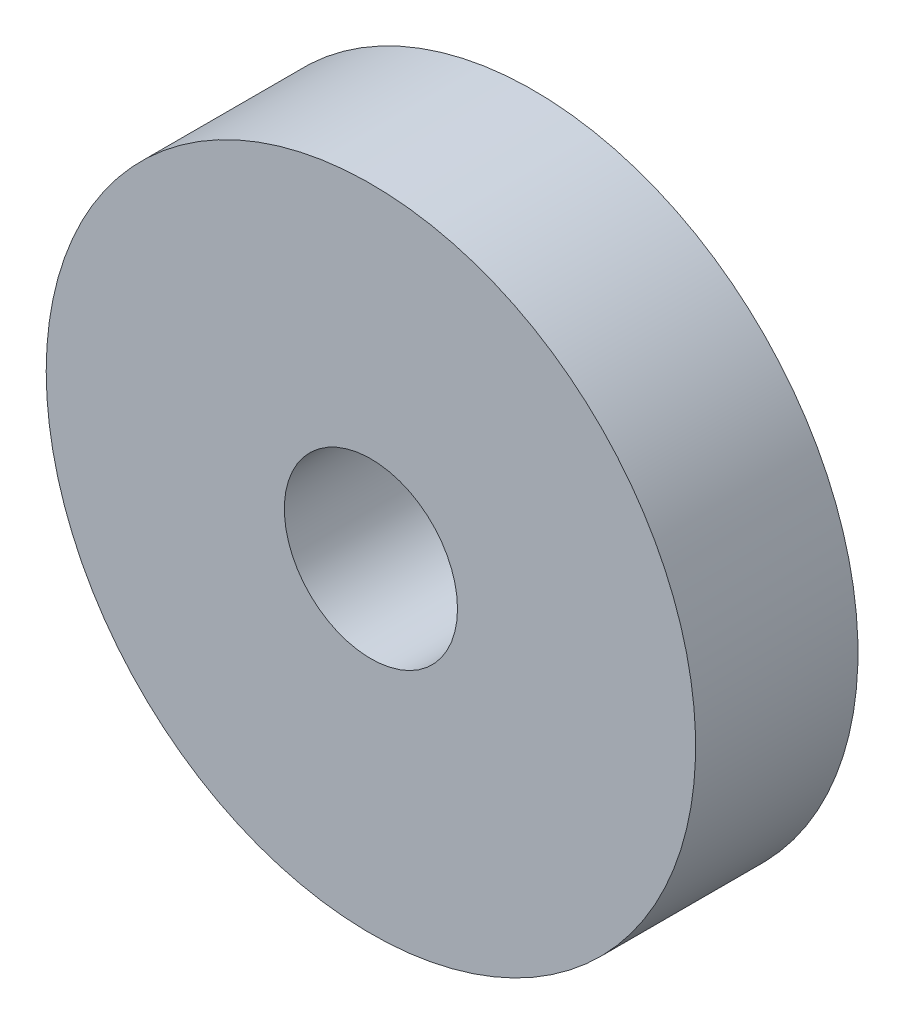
from build123d import *

# Parameters (mm, degrees)
SKETCH1_R           = 9.525
BOSS_EXTRUDE1_DEPTH = 4.7625
SKETCH2_R           = 2.54
CUT_EXTRUDE1_DEPTH  = 15.2875


with BuildPart() as part:
    # Sketch1 → Boss-Extrude1 (new body)
    with BuildSketch(Plane.XY):
        with Locations(Location((0, 0, 0), (0, 0, 180))):
            Circle(SKETCH1_R)
    extrude(amount=BOSS_EXTRUDE1_DEPTH)

    # Sketch2 → Cut-Extrude1 (cut, through all)
    with BuildSketch(Plane.XY.offset(4.7625)):
        Circle(SKETCH2_R)
    extrude(amount=-CUT_EXTRUDE1_DEPTH, mode=Mode.SUBTRACT)


solid = part.part
